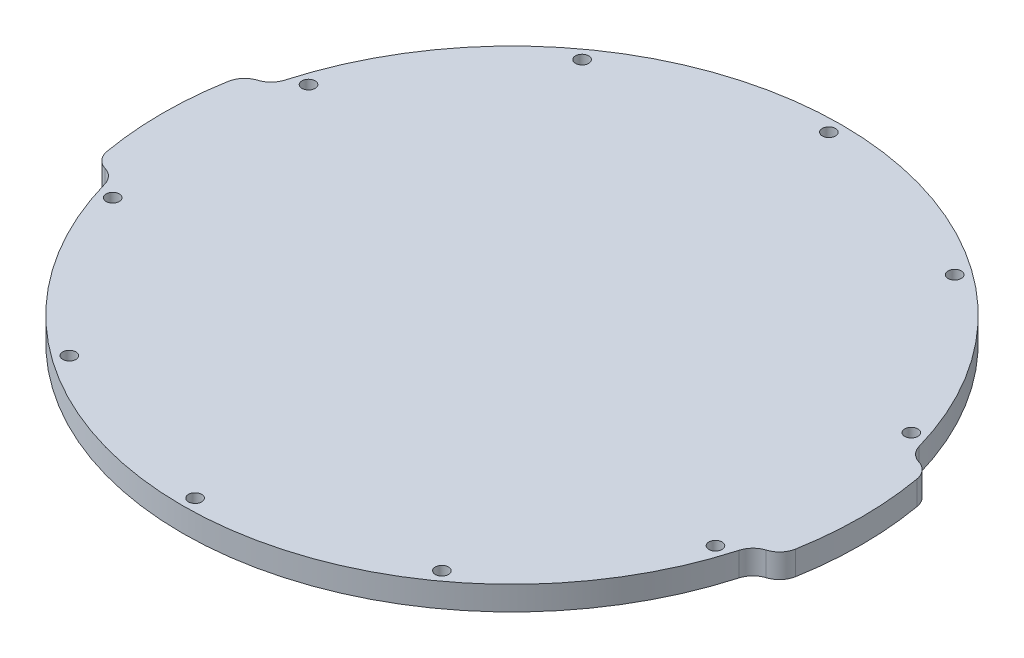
ISO-10303-21;
HEADER;
FILE_DESCRIPTION(('STEP AP214'),'2;1');
FILE_NAME('part.step','',(''),(''),'','','');
FILE_SCHEMA(('AUTOMOTIVE_DESIGN { 1 0 10303 214 1 1 1 1 }'));
ENDSEC;
DATA;
#1=APPLICATION_CONTEXT('core data for automotive mechanical design processes');
#2=APPLICATION_PROTOCOL_DEFINITION('international standard','automotive_design',2000,#1);
#3=PRODUCT_CONTEXT('',#1,'mechanical');
#4=PRODUCT('Part','Part','',(#3));
#5=PRODUCT_RELATED_PRODUCT_CATEGORY('part','',(#4));
#6=PRODUCT_DEFINITION_FORMATION('','',#4);
#7=PRODUCT_DEFINITION_CONTEXT('part definition',#1,'design');
#8=PRODUCT_DEFINITION('design','',#6,#7);
#9=PRODUCT_DEFINITION_SHAPE('','',#8);
#10=(LENGTH_UNIT() NAMED_UNIT(*) SI_UNIT(.MILLI.,.METRE.));
#11=(NAMED_UNIT(*) PLANE_ANGLE_UNIT() SI_UNIT($,.RADIAN.));
#12=(NAMED_UNIT(*) SI_UNIT($,.STERADIAN.) SOLID_ANGLE_UNIT());
#13=UNCERTAINTY_MEASURE_WITH_UNIT(LENGTH_MEASURE(1.E-05),#10,'distance_accuracy_value','');
#14=(GEOMETRIC_REPRESENTATION_CONTEXT(3) GLOBAL_UNCERTAINTY_ASSIGNED_CONTEXT((#13)) GLOBAL_UNIT_ASSIGNED_CONTEXT((#10,
#11,#12)) REPRESENTATION_CONTEXT('',''));
#15=CARTESIAN_POINT('',(0.,0.,0.));
#16=DIRECTION('',(0.,0.,1.));
#17=DIRECTION('',(1.,0.,0.));
#18=AXIS2_PLACEMENT_3D('',#15,#16,#17);
#19=CARTESIAN_POINT('',(-40.6479400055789,6.,-7.16732853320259));
#20=DIRECTION('',(0.,-1.,0.));
#21=DIRECTION('',(0.,0.,-1.));
#22=AXIS2_PLACEMENT_3D('',#19,#20,#21);
#23=PLANE('',#22);
#24=CARTESIAN_POINT('',(-75.4663345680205,6.,-24.5204985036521));
#25=DIRECTION('',(0.,1.,0.));
#26=DIRECTION('',(0.,0.,1.));
#27=AXIS2_PLACEMENT_3D('',#24,#25,#26);
#28=CIRCLE('',#27,1.6500000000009);
#29=CARTESIAN_POINT('',(-75.4663345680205,6.,-22.8704985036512));
#30=VERTEX_POINT('',#29);
#31=EDGE_CURVE('E344',#30,#30,#28,.T.);
#32=ORIENTED_EDGE('',*,*,#31,.F.);
#33=EDGE_LOOP('',(#32));
#34=FACE_BOUND('',#33,.T.);
#35=CARTESIAN_POINT('',(-46.6407597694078,6.,64.1954985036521));
#36=DIRECTION('',(0.,1.,0.));
#37=DIRECTION('',(0.,0.,1.));
#38=AXIS2_PLACEMENT_3D('',#35,#36,#37);
#39=CIRCLE('',#38,1.65000000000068);
#40=CARTESIAN_POINT('',(-46.6407597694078,6.,65.8454985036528));
#41=VERTEX_POINT('',#40);
#42=EDGE_CURVE('E332',#41,#41,#39,.T.);
#43=ORIENTED_EDGE('',*,*,#42,.F.);
#44=EDGE_LOOP('',(#43));
#45=FACE_BOUND('',#44,.T.);
#46=CARTESIAN_POINT('',(46.6407597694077,6.,64.1954985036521));
#47=DIRECTION('',(0.,1.,0.));
#48=DIRECTION('',(0.,0.,1.));
#49=AXIS2_PLACEMENT_3D('',#46,#47,#48);
#50=CIRCLE('',#49,1.65000000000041);
#51=CARTESIAN_POINT('',(46.6407597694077,6.,65.8454985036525));
#52=VERTEX_POINT('',#51);
#53=EDGE_CURVE('E320',#52,#52,#50,.T.);
#54=ORIENTED_EDGE('',*,*,#53,.F.);
#55=EDGE_LOOP('',(#54));
#56=FACE_BOUND('',#55,.T.);
#57=CARTESIAN_POINT('',(75.4663345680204,6.,-24.5204985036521));
#58=DIRECTION('',(0.,1.,0.));
#59=DIRECTION('',(0.,0.,1.));
#60=AXIS2_PLACEMENT_3D('',#57,#58,#59);
#61=CIRCLE('',#60,1.65000000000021);
#62=CARTESIAN_POINT('',(75.4663345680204,6.,-22.8704985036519));
#63=VERTEX_POINT('',#62);
#64=EDGE_CURVE('E308',#63,#63,#61,.T.);
#65=ORIENTED_EDGE('',*,*,#64,.F.);
#66=EDGE_LOOP('',(#65));
#67=FACE_BOUND('',#66,.T.);
#68=CARTESIAN_POINT('',(0.,6.,-79.35));
#69=DIRECTION('',(0.,1.,0.));
#70=DIRECTION('',(0.,0.,1.));
#71=AXIS2_PLACEMENT_3D('',#68,#69,#70);
#72=CIRCLE('',#71,1.65);
#73=CARTESIAN_POINT('',(0.,6.,-77.7));
#74=VERTEX_POINT('',#73);
#75=EDGE_CURVE('E276',#74,#74,#72,.T.);
#76=ORIENTED_EDGE('',*,*,#75,.F.);
#77=EDGE_LOOP('',(#76));
#78=FACE_BOUND('',#77,.T.);
#79=CARTESIAN_POINT('',(0.,6.,0.));
#80=DIRECTION('',(0.,1.,0.));
#81=DIRECTION('',(0.,0.,-1.));
#82=AXIS2_PLACEMENT_3D('',#79,#80,#81);
#83=CIRCLE('',#82,82.55);
#84=CARTESIAN_POINT('',(79.4156922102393,6.,-22.5310969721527));
#85=VERTEX_POINT('',#84);
#86=CARTESIAN_POINT('',(-79.4156922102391,6.,-22.531096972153));
#87=VERTEX_POINT('',#86);
#88=EDGE_CURVE('E271',#85,#87,#83,.T.);
#89=ORIENTED_EDGE('',*,*,#88,.T.);
#90=CARTESIAN_POINT('',(-84.2258492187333,6.,-23.8957909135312));
#91=DIRECTION('',(0.,-1.,0.));
#92=DIRECTION('',(0.,0.,-1.));
#93=AXIS2_PLACEMENT_3D('',#90,#91,#92);
#94=CIRCLE('',#93,5.);
#95=CARTESIAN_POINT('',(-82.7608646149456,6.,-19.1152239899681));
#96=VERTEX_POINT('',#95);
#97=EDGE_CURVE('E127',#87,#96,#94,.T.);
#98=ORIENTED_EDGE('',*,*,#97,.T.);
#99=CARTESIAN_POINT('',(-81.2958800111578,6.,-14.3346570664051));
#100=DIRECTION('',(0.,1.,0.));
#101=DIRECTION('',(0.,0.,-1.));
#102=AXIS2_PLACEMENT_3D('',#99,#100,#101);
#103=CIRCLE('',#102,5.00000000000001);
#104=CARTESIAN_POINT('',(-86.2199187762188,6.,-15.2028979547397));
#105=VERTEX_POINT('',#104);
#106=EDGE_CURVE('E120',#96,#105,#103,.T.);
#107=ORIENTED_EDGE('',*,*,#106,.T.);
#108=CARTESIAN_POINT('',(0.,6.,0.));
#109=DIRECTION('',(0.,1.,0.));
#110=DIRECTION('',(0.,0.,-1.));
#111=AXIS2_PLACEMENT_3D('',#108,#109,#110);
#112=CIRCLE('',#111,87.55);
#113=CARTESIAN_POINT('',(-86.2199187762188,6.,15.2028979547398));
#114=VERTEX_POINT('',#113);
#115=EDGE_CURVE('E124',#105,#114,#112,.T.);
#116=ORIENTED_EDGE('',*,*,#115,.T.);
#117=CARTESIAN_POINT('',(-81.2958800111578,6.,14.3346570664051));
#118=DIRECTION('',(0.,1.,0.));
#119=DIRECTION('',(0.,0.,1.));
#120=AXIS2_PLACEMENT_3D('',#117,#118,#119);
#121=CIRCLE('',#120,5.00000000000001);
#122=CARTESIAN_POINT('',(-82.7608646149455,6.,19.1152239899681));
#123=VERTEX_POINT('',#122);
#124=EDGE_CURVE('E140',#114,#123,#121,.T.);
#125=ORIENTED_EDGE('',*,*,#124,.T.);
#126=CARTESIAN_POINT('',(-84.2258492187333,6.,23.8957909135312));
#127=DIRECTION('',(0.,-1.,0.));
#128=DIRECTION('',(0.,0.,-1.));
#129=AXIS2_PLACEMENT_3D('',#126,#127,#128);
#130=CIRCLE('',#129,5.);
#131=CARTESIAN_POINT('',(-79.4156922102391,6.,22.531096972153));
#132=VERTEX_POINT('',#131);
#133=EDGE_CURVE('E11',#123,#132,#130,.T.);
#134=ORIENTED_EDGE('',*,*,#133,.T.);
#135=CARTESIAN_POINT('',(0.,6.,-4.92661467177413E-13));
#136=DIRECTION('',(0.,1.,0.));
#137=DIRECTION('',(0.,0.,-1.));
#138=AXIS2_PLACEMENT_3D('',#135,#136,#137);
#139=CIRCLE('',#138,82.5500000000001);
#140=CARTESIAN_POINT('',(79.4156922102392,6.,22.5310969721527));
#141=VERTEX_POINT('',#140);
#142=EDGE_CURVE('E258',#132,#141,#139,.T.);
#143=ORIENTED_EDGE('',*,*,#142,.T.);
#144=CARTESIAN_POINT('',(84.2258492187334,6.,23.8957909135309));
#145=DIRECTION('',(0.,-1.,0.));
#146=DIRECTION('',(0.,0.,-1.));
#147=AXIS2_PLACEMENT_3D('',#144,#145,#146);
#148=CIRCLE('',#147,5.);
#149=CARTESIAN_POINT('',(82.7608646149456,6.,19.1152239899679));
#150=VERTEX_POINT('',#149);
#151=EDGE_CURVE('E171',#141,#150,#148,.T.);
#152=ORIENTED_EDGE('',*,*,#151,.T.);
#153=CARTESIAN_POINT('',(81.2958800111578,6.,14.3346570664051));
#154=DIRECTION('',(0.,1.,0.));
#155=DIRECTION('',(0.,0.,-1.));
#156=AXIS2_PLACEMENT_3D('',#153,#154,#155);
#157=CIRCLE('',#156,4.99999999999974);
#158=CARTESIAN_POINT('',(86.2199187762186,6.,15.2028979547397));
#159=VERTEX_POINT('',#158);
#160=EDGE_CURVE('E255',#150,#159,#157,.T.);
#161=ORIENTED_EDGE('',*,*,#160,.T.);
#162=CARTESIAN_POINT('',(-1.29063426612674E-12,6.,0.));
#163=DIRECTION('',(0.,1.,0.));
#164=DIRECTION('',(0.,0.,1.));
#165=AXIS2_PLACEMENT_3D('',#162,#163,#164);
#166=CIRCLE('',#165,87.550000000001);
#167=CARTESIAN_POINT('',(86.2199187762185,6.,-15.2028979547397));
#168=VERTEX_POINT('',#167);
#169=EDGE_CURVE('E262',#159,#168,#166,.T.);
#170=ORIENTED_EDGE('',*,*,#169,.T.);
#171=CARTESIAN_POINT('',(81.2958800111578,6.,-14.3346570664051));
#172=DIRECTION('',(0.,1.,0.));
#173=DIRECTION('',(0.,0.,1.));
#174=AXIS2_PLACEMENT_3D('',#171,#172,#173);
#175=CIRCLE('',#174,4.99999999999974);
#176=CARTESIAN_POINT('',(82.7608646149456,6.,-19.1152239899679));
#177=VERTEX_POINT('',#176);
#178=EDGE_CURVE('E264',#168,#177,#175,.T.);
#179=ORIENTED_EDGE('',*,*,#178,.T.);
#180=CARTESIAN_POINT('',(84.2258492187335,6.,-23.8957909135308));
#181=DIRECTION('',(0.,-1.,0.));
#182=DIRECTION('',(0.,0.,-1.));
#183=AXIS2_PLACEMENT_3D('',#180,#181,#182);
#184=CIRCLE('',#183,5.);
#185=EDGE_CURVE('E175',#177,#85,#184,.T.);
#186=ORIENTED_EDGE('',*,*,#185,.T.);
#187=EDGE_LOOP('',(#89,#98,#107,#116,#125,#134,#143,#152,#161,#170,#179,#186));
#188=FACE_BOUND('',#187,.T.);
#189=CARTESIAN_POINT('',(46.6407597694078,6.,-64.1954985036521));
#190=DIRECTION('',(0.,1.,0.));
#191=DIRECTION('',(0.,0.,1.));
#192=AXIS2_PLACEMENT_3D('',#189,#190,#191);
#193=CIRCLE('',#192,1.65000000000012);
#194=CARTESIAN_POINT('',(46.6407597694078,6.,-62.5454985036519));
#195=VERTEX_POINT('',#194);
#196=EDGE_CURVE('E302',#195,#195,#193,.T.);
#197=ORIENTED_EDGE('',*,*,#196,.F.);
#198=EDGE_LOOP('',(#197));
#199=FACE_BOUND('',#198,.T.);
#200=CARTESIAN_POINT('',(75.4663345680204,6.,24.5204985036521));
#201=DIRECTION('',(0.,1.,0.));
#202=DIRECTION('',(0.,0.,1.));
#203=AXIS2_PLACEMENT_3D('',#200,#201,#202);
#204=CIRCLE('',#203,1.65000000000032);
#205=CARTESIAN_POINT('',(75.4663345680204,6.,26.1704985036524));
#206=VERTEX_POINT('',#205);
#207=EDGE_CURVE('E314',#206,#206,#204,.T.);
#208=ORIENTED_EDGE('',*,*,#207,.F.);
#209=EDGE_LOOP('',(#208));
#210=FACE_BOUND('',#209,.T.);
#211=CARTESIAN_POINT('',(0.,6.,79.35));
#212=DIRECTION('',(0.,1.,0.));
#213=DIRECTION('',(0.,0.,1.));
#214=AXIS2_PLACEMENT_3D('',#211,#212,#213);
#215=CIRCLE('',#214,1.65000000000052);
#216=CARTESIAN_POINT('',(0.,6.,81.0000000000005));
#217=VERTEX_POINT('',#216);
#218=EDGE_CURVE('E326',#217,#217,#215,.T.);
#219=ORIENTED_EDGE('',*,*,#218,.F.);
#220=EDGE_LOOP('',(#219));
#221=FACE_BOUND('',#220,.T.);
#222=CARTESIAN_POINT('',(-75.4663345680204,6.,24.5204985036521));
#223=DIRECTION('',(0.,1.,0.));
#224=DIRECTION('',(0.,0.,1.));
#225=AXIS2_PLACEMENT_3D('',#222,#223,#224);
#226=CIRCLE('',#225,1.65000000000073);
#227=CARTESIAN_POINT('',(-75.4663345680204,6.,26.1704985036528));
#228=VERTEX_POINT('',#227);
#229=EDGE_CURVE('E338',#228,#228,#226,.T.);
#230=ORIENTED_EDGE('',*,*,#229,.F.);
#231=EDGE_LOOP('',(#230));
#232=FACE_BOUND('',#231,.T.);
#233=CARTESIAN_POINT('',(-46.6407597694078,6.,-64.1954985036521));
#234=DIRECTION('',(0.,1.,0.));
#235=DIRECTION('',(0.,0.,1.));
#236=AXIS2_PLACEMENT_3D('',#233,#234,#235);
#237=CIRCLE('',#236,1.65000000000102);
#238=CARTESIAN_POINT('',(-46.6407597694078,6.,-62.545498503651));
#239=VERTEX_POINT('',#238);
#240=EDGE_CURVE('E350',#239,#239,#237,.T.);
#241=ORIENTED_EDGE('',*,*,#240,.F.);
#242=EDGE_LOOP('',(#241));
#243=FACE_BOUND('',#242,.T.);
#244=ADVANCED_FACE('F32',(#34,#45,#56,#67,#78,#188,#199,#210,#221,#232,#243),#23,.F.);
#245=CARTESIAN_POINT('',(-40.6479400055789,0.,-7.16732853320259));
#246=DIRECTION('',(0.,-1.,0.));
#247=DIRECTION('',(0.,0.,-1.));
#248=AXIS2_PLACEMENT_3D('',#245,#246,#247);
#249=PLANE('',#248);
#250=CARTESIAN_POINT('',(-75.4663345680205,0.,-24.5204985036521));
#251=DIRECTION('',(0.,1.,0.));
#252=DIRECTION('',(0.,0.,1.));
#253=AXIS2_PLACEMENT_3D('',#250,#251,#252);
#254=CIRCLE('',#253,1.6500000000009);
#255=CARTESIAN_POINT('',(-75.4663345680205,0.,-22.8704985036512));
#256=VERTEX_POINT('',#255);
#257=EDGE_CURVE('E347',#256,#256,#254,.T.);
#258=ORIENTED_EDGE('',*,*,#257,.T.);
#259=EDGE_LOOP('',(#258));
#260=FACE_BOUND('',#259,.T.);
#261=CARTESIAN_POINT('',(-46.6407597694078,0.,64.1954985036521));
#262=DIRECTION('',(0.,1.,0.));
#263=DIRECTION('',(0.,0.,1.));
#264=AXIS2_PLACEMENT_3D('',#261,#262,#263);
#265=CIRCLE('',#264,1.65000000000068);
#266=CARTESIAN_POINT('',(-46.6407597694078,0.,65.8454985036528));
#267=VERTEX_POINT('',#266);
#268=EDGE_CURVE('E335',#267,#267,#265,.T.);
#269=ORIENTED_EDGE('',*,*,#268,.T.);
#270=EDGE_LOOP('',(#269));
#271=FACE_BOUND('',#270,.T.);
#272=CARTESIAN_POINT('',(46.6407597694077,0.,64.1954985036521));
#273=DIRECTION('',(0.,1.,0.));
#274=DIRECTION('',(0.,0.,1.));
#275=AXIS2_PLACEMENT_3D('',#272,#273,#274);
#276=CIRCLE('',#275,1.65000000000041);
#277=CARTESIAN_POINT('',(46.6407597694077,0.,65.8454985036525));
#278=VERTEX_POINT('',#277);
#279=EDGE_CURVE('E323',#278,#278,#276,.T.);
#280=ORIENTED_EDGE('',*,*,#279,.T.);
#281=EDGE_LOOP('',(#280));
#282=FACE_BOUND('',#281,.T.);
#283=CARTESIAN_POINT('',(75.4663345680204,0.,-24.5204985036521));
#284=DIRECTION('',(0.,1.,0.));
#285=DIRECTION('',(0.,0.,1.));
#286=AXIS2_PLACEMENT_3D('',#283,#284,#285);
#287=CIRCLE('',#286,1.65000000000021);
#288=CARTESIAN_POINT('',(75.4663345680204,0.,-22.8704985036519));
#289=VERTEX_POINT('',#288);
#290=EDGE_CURVE('E311',#289,#289,#287,.T.);
#291=ORIENTED_EDGE('',*,*,#290,.T.);
#292=EDGE_LOOP('',(#291));
#293=FACE_BOUND('',#292,.T.);
#294=CARTESIAN_POINT('',(0.,0.,-79.35));
#295=DIRECTION('',(0.,1.,0.));
#296=DIRECTION('',(0.,0.,1.));
#297=AXIS2_PLACEMENT_3D('',#294,#295,#296);
#298=CIRCLE('',#297,1.65);
#299=CARTESIAN_POINT('',(0.,0.,-77.7));
#300=VERTEX_POINT('',#299);
#301=EDGE_CURVE('E299',#300,#300,#298,.T.);
#302=ORIENTED_EDGE('',*,*,#301,.T.);
#303=EDGE_LOOP('',(#302));
#304=FACE_BOUND('',#303,.T.);
#305=CARTESIAN_POINT('',(-81.2958800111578,0.,-14.3346570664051));
#306=DIRECTION('',(0.,1.,0.));
#307=DIRECTION('',(0.,0.,-1.));
#308=AXIS2_PLACEMENT_3D('',#305,#306,#307);
#309=CIRCLE('',#308,5.00000000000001);
#310=CARTESIAN_POINT('',(-82.7608646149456,0.,-19.1152239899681));
#311=VERTEX_POINT('',#310);
#312=CARTESIAN_POINT('',(-86.2199187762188,0.,-15.2028979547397));
#313=VERTEX_POINT('',#312);
#314=EDGE_CURVE('E144',#311,#313,#309,.T.);
#315=ORIENTED_EDGE('',*,*,#314,.F.);
#316=CARTESIAN_POINT('',(-84.2258492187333,0.,-23.8957909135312));
#317=DIRECTION('',(0.,-1.,0.));
#318=DIRECTION('',(0.,0.,-1.));
#319=AXIS2_PLACEMENT_3D('',#316,#317,#318);
#320=CIRCLE('',#319,5.);
#321=CARTESIAN_POINT('',(-79.4156922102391,0.,-22.531096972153));
#322=VERTEX_POINT('',#321);
#323=EDGE_CURVE('E177',#311,#322,#320,.F.);
#324=ORIENTED_EDGE('',*,*,#323,.T.);
#325=CARTESIAN_POINT('',(0.,0.,0.));
#326=DIRECTION('',(0.,1.,0.));
#327=DIRECTION('',(0.,0.,-1.));
#328=AXIS2_PLACEMENT_3D('',#325,#326,#327);
#329=CIRCLE('',#328,82.55);
#330=CARTESIAN_POINT('',(79.4156922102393,0.,-22.5310969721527));
#331=VERTEX_POINT('',#330);
#332=EDGE_CURVE('E132',#331,#322,#329,.T.);
#333=ORIENTED_EDGE('',*,*,#332,.F.);
#334=CARTESIAN_POINT('',(84.2258492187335,0.,-23.8957909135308));
#335=DIRECTION('',(0.,-1.,0.));
#336=DIRECTION('',(0.,0.,-1.));
#337=AXIS2_PLACEMENT_3D('',#334,#335,#336);
#338=CIRCLE('',#337,5.);
#339=CARTESIAN_POINT('',(82.7608646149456,0.,-19.1152239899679));
#340=VERTEX_POINT('',#339);
#341=EDGE_CURVE('E173',#331,#340,#338,.F.);
#342=ORIENTED_EDGE('',*,*,#341,.T.);
#343=CARTESIAN_POINT('',(81.2958800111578,0.,-14.3346570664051));
#344=DIRECTION('',(0.,1.,0.));
#345=DIRECTION('',(0.,0.,1.));
#346=AXIS2_PLACEMENT_3D('',#343,#344,#345);
#347=CIRCLE('',#346,4.99999999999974);
#348=CARTESIAN_POINT('',(86.2199187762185,0.,-15.2028979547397));
#349=VERTEX_POINT('',#348);
#350=EDGE_CURVE('E189',#349,#340,#347,.T.);
#351=ORIENTED_EDGE('',*,*,#350,.F.);
#352=CARTESIAN_POINT('',(-1.29063426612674E-12,0.,0.));
#353=DIRECTION('',(0.,1.,0.));
#354=DIRECTION('',(0.,0.,1.));
#355=AXIS2_PLACEMENT_3D('',#352,#353,#354);
#356=CIRCLE('',#355,87.550000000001);
#357=CARTESIAN_POINT('',(86.2199187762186,0.,15.2028979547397));
#358=VERTEX_POINT('',#357);
#359=EDGE_CURVE('E285',#358,#349,#356,.T.);
#360=ORIENTED_EDGE('',*,*,#359,.F.);
#361=CARTESIAN_POINT('',(81.2958800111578,0.,14.3346570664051));
#362=DIRECTION('',(0.,1.,0.));
#363=DIRECTION('',(0.,0.,-1.));
#364=AXIS2_PLACEMENT_3D('',#361,#362,#363);
#365=CIRCLE('',#364,4.99999999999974);
#366=CARTESIAN_POINT('',(82.7608646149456,0.,19.1152239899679));
#367=VERTEX_POINT('',#366);
#368=EDGE_CURVE('E283',#367,#358,#365,.T.);
#369=ORIENTED_EDGE('',*,*,#368,.F.);
#370=CARTESIAN_POINT('',(84.2258492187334,0.,23.8957909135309));
#371=DIRECTION('',(0.,-1.,0.));
#372=DIRECTION('',(0.,0.,-1.));
#373=AXIS2_PLACEMENT_3D('',#370,#371,#372);
#374=CIRCLE('',#373,5.);
#375=CARTESIAN_POINT('',(79.4156922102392,0.,22.5310969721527));
#376=VERTEX_POINT('',#375);
#377=EDGE_CURVE('E169',#367,#376,#374,.F.);
#378=ORIENTED_EDGE('',*,*,#377,.T.);
#379=CARTESIAN_POINT('',(0.,0.,-4.92661467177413E-13));
#380=DIRECTION('',(0.,1.,0.));
#381=DIRECTION('',(0.,0.,-1.));
#382=AXIS2_PLACEMENT_3D('',#379,#380,#381);
#383=CIRCLE('',#382,82.5500000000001);
#384=CARTESIAN_POINT('',(-79.4156922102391,0.,22.531096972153));
#385=VERTEX_POINT('',#384);
#386=EDGE_CURVE('E280',#385,#376,#383,.T.);
#387=ORIENTED_EDGE('',*,*,#386,.F.);
#388=CARTESIAN_POINT('',(-84.2258492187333,0.,23.8957909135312));
#389=DIRECTION('',(0.,-1.,0.));
#390=DIRECTION('',(0.,0.,-1.));
#391=AXIS2_PLACEMENT_3D('',#388,#389,#390);
#392=CIRCLE('',#391,5.);
#393=CARTESIAN_POINT('',(-82.7608646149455,0.,19.1152239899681));
#394=VERTEX_POINT('',#393);
#395=EDGE_CURVE('E40',#385,#394,#392,.F.);
#396=ORIENTED_EDGE('',*,*,#395,.T.);
#397=CARTESIAN_POINT('',(-81.2958800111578,0.,14.3346570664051));
#398=DIRECTION('',(0.,1.,0.));
#399=DIRECTION('',(0.,0.,1.));
#400=AXIS2_PLACEMENT_3D('',#397,#398,#399);
#401=CIRCLE('',#400,5.00000000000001);
#402=CARTESIAN_POINT('',(-86.2199187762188,0.,15.2028979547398));
#403=VERTEX_POINT('',#402);
#404=EDGE_CURVE('E278',#403,#394,#401,.T.);
#405=ORIENTED_EDGE('',*,*,#404,.F.);
#406=CARTESIAN_POINT('',(0.,0.,0.));
#407=DIRECTION('',(0.,1.,0.));
#408=DIRECTION('',(0.,0.,-1.));
#409=AXIS2_PLACEMENT_3D('',#406,#407,#408);
#410=CIRCLE('',#409,87.55);
#411=EDGE_CURVE('E275',#313,#403,#410,.T.);
#412=ORIENTED_EDGE('',*,*,#411,.F.);
#413=EDGE_LOOP('',(#315,#324,#333,#342,#351,#360,#369,#378,#387,#396,#405,#412));
#414=FACE_BOUND('',#413,.T.);
#415=CARTESIAN_POINT('',(46.6407597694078,0.,-64.1954985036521));
#416=DIRECTION('',(0.,1.,0.));
#417=DIRECTION('',(0.,0.,1.));
#418=AXIS2_PLACEMENT_3D('',#415,#416,#417);
#419=CIRCLE('',#418,1.65000000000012);
#420=CARTESIAN_POINT('',(46.6407597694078,0.,-62.5454985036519));
#421=VERTEX_POINT('',#420);
#422=EDGE_CURVE('E305',#421,#421,#419,.T.);
#423=ORIENTED_EDGE('',*,*,#422,.T.);
#424=EDGE_LOOP('',(#423));
#425=FACE_BOUND('',#424,.T.);
#426=CARTESIAN_POINT('',(75.4663345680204,0.,24.5204985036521));
#427=DIRECTION('',(0.,1.,0.));
#428=DIRECTION('',(0.,0.,1.));
#429=AXIS2_PLACEMENT_3D('',#426,#427,#428);
#430=CIRCLE('',#429,1.65000000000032);
#431=CARTESIAN_POINT('',(75.4663345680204,0.,26.1704985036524));
#432=VERTEX_POINT('',#431);
#433=EDGE_CURVE('E317',#432,#432,#430,.T.);
#434=ORIENTED_EDGE('',*,*,#433,.T.);
#435=EDGE_LOOP('',(#434));
#436=FACE_BOUND('',#435,.T.);
#437=CARTESIAN_POINT('',(0.,0.,79.35));
#438=DIRECTION('',(0.,1.,0.));
#439=DIRECTION('',(0.,0.,1.));
#440=AXIS2_PLACEMENT_3D('',#437,#438,#439);
#441=CIRCLE('',#440,1.65000000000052);
#442=CARTESIAN_POINT('',(0.,0.,81.0000000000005));
#443=VERTEX_POINT('',#442);
#444=EDGE_CURVE('E329',#443,#443,#441,.T.);
#445=ORIENTED_EDGE('',*,*,#444,.T.);
#446=EDGE_LOOP('',(#445));
#447=FACE_BOUND('',#446,.T.);
#448=CARTESIAN_POINT('',(-75.4663345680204,0.,24.5204985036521));
#449=DIRECTION('',(0.,1.,0.));
#450=DIRECTION('',(0.,0.,1.));
#451=AXIS2_PLACEMENT_3D('',#448,#449,#450);
#452=CIRCLE('',#451,1.65000000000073);
#453=CARTESIAN_POINT('',(-75.4663345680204,0.,26.1704985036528));
#454=VERTEX_POINT('',#453);
#455=EDGE_CURVE('E341',#454,#454,#452,.T.);
#456=ORIENTED_EDGE('',*,*,#455,.T.);
#457=EDGE_LOOP('',(#456));
#458=FACE_BOUND('',#457,.T.);
#459=CARTESIAN_POINT('',(-46.6407597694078,0.,-64.1954985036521));
#460=DIRECTION('',(0.,1.,0.));
#461=DIRECTION('',(0.,0.,1.));
#462=AXIS2_PLACEMENT_3D('',#459,#460,#461);
#463=CIRCLE('',#462,1.65000000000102);
#464=CARTESIAN_POINT('',(-46.6407597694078,0.,-62.545498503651));
#465=VERTEX_POINT('',#464);
#466=EDGE_CURVE('E353',#465,#465,#463,.T.);
#467=ORIENTED_EDGE('',*,*,#466,.T.);
#468=EDGE_LOOP('',(#467));
#469=FACE_BOUND('',#468,.T.);
#470=ADVANCED_FACE('F181',(#260,#271,#282,#293,#304,#414,#425,#436,#447,#458,#469),#249,.T.);
#471=CARTESIAN_POINT('',(-81.2958800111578,6.,-14.3346570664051));
#472=DIRECTION('',(0.,-1.,0.));
#473=DIRECTION('',(0.,0.,-1.));
#474=AXIS2_PLACEMENT_3D('',#471,#472,#473);
#475=CYLINDRICAL_SURFACE('',#474,5.00000000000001);
#476=ORIENTED_EDGE('',*,*,#106,.F.);
#477=DIRECTION('',(0.,-1.,0.));
#478=VECTOR('',#477,1.);
#479=CARTESIAN_POINT('',(-82.7608646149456,6.,-19.1152239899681));
#480=LINE('',#479,#478);
#481=EDGE_CURVE('E166',#96,#311,#480,.T.);
#482=ORIENTED_EDGE('',*,*,#481,.T.);
#483=ORIENTED_EDGE('',*,*,#314,.T.);
#484=DIRECTION('',(0.,-1.,0.));
#485=VECTOR('',#484,1.);
#486=CARTESIAN_POINT('',(-86.2199187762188,6.,-15.2028979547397));
#487=LINE('',#486,#485);
#488=EDGE_CURVE('E137',#105,#313,#487,.T.);
#489=ORIENTED_EDGE('',*,*,#488,.F.);
#490=EDGE_LOOP('',(#476,#482,#483,#489));
#491=FACE_BOUND('',#490,.T.);
#492=ADVANCED_FACE('F142',(#491),#475,.T.);
#493=CARTESIAN_POINT('',(0.,6.,0.));
#494=DIRECTION('',(0.,-1.,0.));
#495=DIRECTION('',(0.,0.,-1.));
#496=AXIS2_PLACEMENT_3D('',#493,#494,#495);
#497=CYLINDRICAL_SURFACE('',#496,87.55);
#498=ORIENTED_EDGE('',*,*,#411,.T.);
#499=DIRECTION('',(0.,-1.,0.));
#500=VECTOR('',#499,1.);
#501=CARTESIAN_POINT('',(-86.2199187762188,6.,15.2028979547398));
#502=LINE('',#501,#500);
#503=EDGE_CURVE('E139',#114,#403,#502,.T.);
#504=ORIENTED_EDGE('',*,*,#503,.F.);
#505=ORIENTED_EDGE('',*,*,#115,.F.);
#506=ORIENTED_EDGE('',*,*,#488,.T.);
#507=EDGE_LOOP('',(#498,#504,#505,#506));
#508=FACE_BOUND('',#507,.T.);
#509=ADVANCED_FACE('F136',(#508),#497,.T.);
#510=CARTESIAN_POINT('',(-81.2958800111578,6.,14.3346570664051));
#511=DIRECTION('',(0.,-1.,0.));
#512=DIRECTION('',(0.,0.,-1.));
#513=AXIS2_PLACEMENT_3D('',#510,#511,#512);
#514=CYLINDRICAL_SURFACE('',#513,5.00000000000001);
#515=ORIENTED_EDGE('',*,*,#404,.T.);
#516=DIRECTION('',(0.,-1.,0.));
#517=VECTOR('',#516,1.);
#518=CARTESIAN_POINT('',(-82.7608646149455,6.,19.1152239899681));
#519=LINE('',#518,#517);
#520=EDGE_CURVE('E47',#394,#123,#519,.F.);
#521=ORIENTED_EDGE('',*,*,#520,.T.);
#522=ORIENTED_EDGE('',*,*,#124,.F.);
#523=ORIENTED_EDGE('',*,*,#503,.T.);
#524=EDGE_LOOP('',(#515,#521,#522,#523));
#525=FACE_BOUND('',#524,.T.);
#526=ADVANCED_FACE('F233',(#525),#514,.T.);
#527=CARTESIAN_POINT('',(0.,6.,-4.92661467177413E-13));
#528=DIRECTION('',(0.,-1.,0.));
#529=DIRECTION('',(0.,0.,-1.));
#530=AXIS2_PLACEMENT_3D('',#527,#528,#529);
#531=CYLINDRICAL_SURFACE('',#530,82.5500000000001);
#532=ORIENTED_EDGE('',*,*,#386,.T.);
#533=DIRECTION('',(0.,-1.,0.));
#534=VECTOR('',#533,1.);
#535=CARTESIAN_POINT('',(79.4156922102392,6.,22.5310969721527));
#536=LINE('',#535,#534);
#537=EDGE_CURVE('E157',#376,#141,#536,.F.);
#538=ORIENTED_EDGE('',*,*,#537,.T.);
#539=ORIENTED_EDGE('',*,*,#142,.F.);
#540=DIRECTION('',(0.,-1.,0.));
#541=VECTOR('',#540,1.);
#542=CARTESIAN_POINT('',(-79.4156922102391,6.,22.531096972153));
#543=LINE('',#542,#541);
#544=EDGE_CURVE('E149',#132,#385,#543,.T.);
#545=ORIENTED_EDGE('',*,*,#544,.T.);
#546=EDGE_LOOP('',(#532,#538,#539,#545));
#547=FACE_BOUND('',#546,.T.);
#548=ADVANCED_FACE('F229',(#547),#531,.T.);
#549=CARTESIAN_POINT('',(81.2958800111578,6.,14.3346570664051));
#550=DIRECTION('',(0.,-1.,0.));
#551=DIRECTION('',(0.,0.,-1.));
#552=AXIS2_PLACEMENT_3D('',#549,#550,#551);
#553=CYLINDRICAL_SURFACE('',#552,4.99999999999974);
#554=ORIENTED_EDGE('',*,*,#160,.F.);
#555=DIRECTION('',(0.,-1.,0.));
#556=VECTOR('',#555,1.);
#557=CARTESIAN_POINT('',(82.7608646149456,6.,19.1152239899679));
#558=LINE('',#557,#556);
#559=EDGE_CURVE('E146',#150,#367,#558,.T.);
#560=ORIENTED_EDGE('',*,*,#559,.T.);
#561=ORIENTED_EDGE('',*,*,#368,.T.);
#562=DIRECTION('',(0.,-1.,0.));
#563=VECTOR('',#562,1.);
#564=CARTESIAN_POINT('',(86.2199187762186,6.,15.2028979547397));
#565=LINE('',#564,#563);
#566=EDGE_CURVE('E151',#159,#358,#565,.T.);
#567=ORIENTED_EDGE('',*,*,#566,.F.);
#568=EDGE_LOOP('',(#554,#560,#561,#567));
#569=FACE_BOUND('',#568,.T.);
#570=ADVANCED_FACE('F225',(#569),#553,.T.);
#571=CARTESIAN_POINT('',(-1.29063426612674E-12,6.,0.));
#572=DIRECTION('',(0.,-1.,0.));
#573=DIRECTION('',(0.,0.,-1.));
#574=AXIS2_PLACEMENT_3D('',#571,#572,#573);
#575=CYLINDRICAL_SURFACE('',#574,87.550000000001);
#576=ORIENTED_EDGE('',*,*,#359,.T.);
#577=DIRECTION('',(0.,-1.,0.));
#578=VECTOR('',#577,1.);
#579=CARTESIAN_POINT('',(86.2199187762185,6.,-15.2028979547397));
#580=LINE('',#579,#578);
#581=EDGE_CURVE('E273',#168,#349,#580,.T.);
#582=ORIENTED_EDGE('',*,*,#581,.F.);
#583=ORIENTED_EDGE('',*,*,#169,.F.);
#584=ORIENTED_EDGE('',*,*,#566,.T.);
#585=EDGE_LOOP('',(#576,#582,#583,#584));
#586=FACE_BOUND('',#585,.T.);
#587=ADVANCED_FACE('F221',(#586),#575,.T.);
#588=CARTESIAN_POINT('',(81.2958800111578,6.,-14.3346570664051));
#589=DIRECTION('',(0.,-1.,0.));
#590=DIRECTION('',(0.,0.,-1.));
#591=AXIS2_PLACEMENT_3D('',#588,#589,#590);
#592=CYLINDRICAL_SURFACE('',#591,4.99999999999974);
#593=ORIENTED_EDGE('',*,*,#350,.T.);
#594=DIRECTION('',(0.,-1.,0.));
#595=VECTOR('',#594,1.);
#596=CARTESIAN_POINT('',(82.7608646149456,6.,-19.1152239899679));
#597=LINE('',#596,#595);
#598=EDGE_CURVE('E164',#340,#177,#597,.F.);
#599=ORIENTED_EDGE('',*,*,#598,.T.);
#600=ORIENTED_EDGE('',*,*,#178,.F.);
#601=ORIENTED_EDGE('',*,*,#581,.T.);
#602=EDGE_LOOP('',(#593,#599,#600,#601));
#603=FACE_BOUND('',#602,.T.);
#604=ADVANCED_FACE('F218',(#603),#592,.T.);
#605=CARTESIAN_POINT('',(0.,6.,0.));
#606=DIRECTION('',(0.,-1.,0.));
#607=DIRECTION('',(0.,0.,-1.));
#608=AXIS2_PLACEMENT_3D('',#605,#606,#607);
#609=CYLINDRICAL_SURFACE('',#608,82.55);
#610=ORIENTED_EDGE('',*,*,#88,.F.);
#611=DIRECTION('',(0.,-1.,0.));
#612=VECTOR('',#611,1.);
#613=CARTESIAN_POINT('',(79.4156922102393,6.,-22.5310969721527));
#614=LINE('',#613,#612);
#615=EDGE_CURVE('E161',#85,#331,#614,.T.);
#616=ORIENTED_EDGE('',*,*,#615,.T.);
#617=ORIENTED_EDGE('',*,*,#332,.T.);
#618=DIRECTION('',(0.,-1.,0.));
#619=VECTOR('',#618,1.);
#620=CARTESIAN_POINT('',(-79.4156922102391,6.,-22.531096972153));
#621=LINE('',#620,#619);
#622=EDGE_CURVE('E159',#322,#87,#621,.F.);
#623=ORIENTED_EDGE('',*,*,#622,.T.);
#624=EDGE_LOOP('',(#610,#616,#617,#623));
#625=FACE_BOUND('',#624,.T.);
#626=ADVANCED_FACE('F187',(#625),#609,.T.);
#627=CARTESIAN_POINT('',(0.,6.,-79.35));
#628=DIRECTION('',(0.,-1.,0.));
#629=DIRECTION('',(0.,0.,-1.));
#630=AXIS2_PLACEMENT_3D('',#627,#628,#629);
#631=CYLINDRICAL_SURFACE('',#630,1.65);
#632=ORIENTED_EDGE('',*,*,#75,.T.);
#633=EDGE_LOOP('',(#632));
#634=FACE_BOUND('',#633,.T.);
#635=ORIENTED_EDGE('',*,*,#301,.F.);
#636=EDGE_LOOP('',(#635));
#637=FACE_BOUND('',#636,.T.);
#638=ADVANCED_FACE('F213',(#634,#637),#631,.F.);
#639=CARTESIAN_POINT('',(46.6407597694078,6.,-64.1954985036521));
#640=DIRECTION('',(0.,-1.,0.));
#641=DIRECTION('',(0.,0.,-1.));
#642=AXIS2_PLACEMENT_3D('',#639,#640,#641);
#643=CYLINDRICAL_SURFACE('',#642,1.65000000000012);
#644=ORIENTED_EDGE('',*,*,#196,.T.);
#645=EDGE_LOOP('',(#644));
#646=FACE_BOUND('',#645,.T.);
#647=ORIENTED_EDGE('',*,*,#422,.F.);
#648=EDGE_LOOP('',(#647));
#649=FACE_BOUND('',#648,.T.);
#650=ADVANCED_FACE('F378',(#646,#649),#643,.F.);
#651=CARTESIAN_POINT('',(75.4663345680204,6.,-24.5204985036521));
#652=DIRECTION('',(0.,-1.,0.));
#653=DIRECTION('',(0.,0.,-1.));
#654=AXIS2_PLACEMENT_3D('',#651,#652,#653);
#655=CYLINDRICAL_SURFACE('',#654,1.65000000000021);
#656=ORIENTED_EDGE('',*,*,#64,.T.);
#657=EDGE_LOOP('',(#656));
#658=FACE_BOUND('',#657,.T.);
#659=ORIENTED_EDGE('',*,*,#290,.F.);
#660=EDGE_LOOP('',(#659));
#661=FACE_BOUND('',#660,.T.);
#662=ADVANCED_FACE('F383',(#658,#661),#655,.F.);
#663=CARTESIAN_POINT('',(75.4663345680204,6.,24.5204985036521));
#664=DIRECTION('',(0.,-1.,0.));
#665=DIRECTION('',(0.,0.,-1.));
#666=AXIS2_PLACEMENT_3D('',#663,#664,#665);
#667=CYLINDRICAL_SURFACE('',#666,1.65000000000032);
#668=ORIENTED_EDGE('',*,*,#207,.T.);
#669=EDGE_LOOP('',(#668));
#670=FACE_BOUND('',#669,.T.);
#671=ORIENTED_EDGE('',*,*,#433,.F.);
#672=EDGE_LOOP('',(#671));
#673=FACE_BOUND('',#672,.T.);
#674=ADVANCED_FACE('F390',(#670,#673),#667,.F.);
#675=CARTESIAN_POINT('',(46.6407597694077,6.,64.1954985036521));
#676=DIRECTION('',(0.,-1.,0.));
#677=DIRECTION('',(0.,0.,-1.));
#678=AXIS2_PLACEMENT_3D('',#675,#676,#677);
#679=CYLINDRICAL_SURFACE('',#678,1.65000000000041);
#680=ORIENTED_EDGE('',*,*,#53,.T.);
#681=EDGE_LOOP('',(#680));
#682=FACE_BOUND('',#681,.T.);
#683=ORIENTED_EDGE('',*,*,#279,.F.);
#684=EDGE_LOOP('',(#683));
#685=FACE_BOUND('',#684,.T.);
#686=ADVANCED_FACE('F397',(#682,#685),#679,.F.);
#687=CARTESIAN_POINT('',(0.,6.,79.35));
#688=DIRECTION('',(0.,-1.,0.));
#689=DIRECTION('',(0.,0.,-1.));
#690=AXIS2_PLACEMENT_3D('',#687,#688,#689);
#691=CYLINDRICAL_SURFACE('',#690,1.65000000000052);
#692=ORIENTED_EDGE('',*,*,#218,.T.);
#693=EDGE_LOOP('',(#692));
#694=FACE_BOUND('',#693,.T.);
#695=ORIENTED_EDGE('',*,*,#444,.F.);
#696=EDGE_LOOP('',(#695));
#697=FACE_BOUND('',#696,.T.);
#698=ADVANCED_FACE('F401',(#694,#697),#691,.F.);
#699=CARTESIAN_POINT('',(-46.6407597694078,6.,64.1954985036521));
#700=DIRECTION('',(0.,-1.,0.));
#701=DIRECTION('',(0.,0.,-1.));
#702=AXIS2_PLACEMENT_3D('',#699,#700,#701);
#703=CYLINDRICAL_SURFACE('',#702,1.65000000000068);
#704=ORIENTED_EDGE('',*,*,#42,.T.);
#705=EDGE_LOOP('',(#704));
#706=FACE_BOUND('',#705,.T.);
#707=ORIENTED_EDGE('',*,*,#268,.F.);
#708=EDGE_LOOP('',(#707));
#709=FACE_BOUND('',#708,.T.);
#710=ADVANCED_FACE('F405',(#706,#709),#703,.F.);
#711=CARTESIAN_POINT('',(-75.4663345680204,6.,24.5204985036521));
#712=DIRECTION('',(0.,-1.,0.));
#713=DIRECTION('',(0.,0.,-1.));
#714=AXIS2_PLACEMENT_3D('',#711,#712,#713);
#715=CYLINDRICAL_SURFACE('',#714,1.65000000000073);
#716=ORIENTED_EDGE('',*,*,#229,.T.);
#717=EDGE_LOOP('',(#716));
#718=FACE_BOUND('',#717,.T.);
#719=ORIENTED_EDGE('',*,*,#455,.F.);
#720=EDGE_LOOP('',(#719));
#721=FACE_BOUND('',#720,.T.);
#722=ADVANCED_FACE('F365',(#718,#721),#715,.F.);
#723=CARTESIAN_POINT('',(-75.4663345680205,6.,-24.5204985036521));
#724=DIRECTION('',(0.,-1.,0.));
#725=DIRECTION('',(0.,0.,-1.));
#726=AXIS2_PLACEMENT_3D('',#723,#724,#725);
#727=CYLINDRICAL_SURFACE('',#726,1.6500000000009);
#728=ORIENTED_EDGE('',*,*,#31,.T.);
#729=EDGE_LOOP('',(#728));
#730=FACE_BOUND('',#729,.T.);
#731=ORIENTED_EDGE('',*,*,#257,.F.);
#732=EDGE_LOOP('',(#731));
#733=FACE_BOUND('',#732,.T.);
#734=ADVANCED_FACE('F247',(#730,#733),#727,.F.);
#735=CARTESIAN_POINT('',(-46.6407597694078,6.,-64.1954985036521));
#736=DIRECTION('',(0.,-1.,0.));
#737=DIRECTION('',(0.,0.,-1.));
#738=AXIS2_PLACEMENT_3D('',#735,#736,#737);
#739=CYLINDRICAL_SURFACE('',#738,1.65000000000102);
#740=ORIENTED_EDGE('',*,*,#240,.T.);
#741=EDGE_LOOP('',(#740));
#742=FACE_BOUND('',#741,.T.);
#743=ORIENTED_EDGE('',*,*,#466,.F.);
#744=EDGE_LOOP('',(#743));
#745=FACE_BOUND('',#744,.T.);
#746=ADVANCED_FACE('F242',(#742,#745),#739,.F.);
#747=CARTESIAN_POINT('',(84.2258492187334,6.,23.8957909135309));
#748=DIRECTION('',(0.,1.,0.));
#749=DIRECTION('',(0.,0.,1.));
#750=AXIS2_PLACEMENT_3D('',#747,#748,#749);
#751=CYLINDRICAL_SURFACE('',#750,5.);
#752=ORIENTED_EDGE('',*,*,#151,.F.);
#753=ORIENTED_EDGE('',*,*,#537,.F.);
#754=ORIENTED_EDGE('',*,*,#377,.F.);
#755=ORIENTED_EDGE('',*,*,#559,.F.);
#756=EDGE_LOOP('',(#752,#753,#754,#755));
#757=FACE_BOUND('',#756,.T.);
#758=ADVANCED_FACE('F199',(#757),#751,.F.);
#759=CARTESIAN_POINT('',(84.2258492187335,6.,-23.8957909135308));
#760=DIRECTION('',(0.,1.,0.));
#761=DIRECTION('',(0.,0.,1.));
#762=AXIS2_PLACEMENT_3D('',#759,#760,#761);
#763=CYLINDRICAL_SURFACE('',#762,5.);
#764=ORIENTED_EDGE('',*,*,#185,.F.);
#765=ORIENTED_EDGE('',*,*,#598,.F.);
#766=ORIENTED_EDGE('',*,*,#341,.F.);
#767=ORIENTED_EDGE('',*,*,#615,.F.);
#768=EDGE_LOOP('',(#764,#765,#766,#767));
#769=FACE_BOUND('',#768,.T.);
#770=ADVANCED_FACE('F193',(#769),#763,.F.);
#771=CARTESIAN_POINT('',(-84.2258492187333,6.,-23.8957909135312));
#772=DIRECTION('',(0.,1.,0.));
#773=DIRECTION('',(0.,0.,1.));
#774=AXIS2_PLACEMENT_3D('',#771,#772,#773);
#775=CYLINDRICAL_SURFACE('',#774,5.);
#776=ORIENTED_EDGE('',*,*,#97,.F.);
#777=ORIENTED_EDGE('',*,*,#622,.F.);
#778=ORIENTED_EDGE('',*,*,#323,.F.);
#779=ORIENTED_EDGE('',*,*,#481,.F.);
#780=EDGE_LOOP('',(#776,#777,#778,#779));
#781=FACE_BOUND('',#780,.T.);
#782=ADVANCED_FACE('F191',(#781),#775,.F.);
#783=CARTESIAN_POINT('',(-84.2258492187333,6.,23.8957909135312));
#784=DIRECTION('',(0.,1.,0.));
#785=DIRECTION('',(0.,0.,1.));
#786=AXIS2_PLACEMENT_3D('',#783,#784,#785);
#787=CYLINDRICAL_SURFACE('',#786,5.);
#788=ORIENTED_EDGE('',*,*,#133,.F.);
#789=ORIENTED_EDGE('',*,*,#520,.F.);
#790=ORIENTED_EDGE('',*,*,#395,.F.);
#791=ORIENTED_EDGE('',*,*,#544,.F.);
#792=EDGE_LOOP('',(#788,#789,#790,#791));
#793=FACE_BOUND('',#792,.T.);
#794=ADVANCED_FACE('F34',(#793),#787,.F.);
#795=CLOSED_SHELL('',(#244,#470,#492,#509,#526,#548,#570,#587,#604,#626,#638,#650,#662,#674,
#686,#698,#710,#722,#734,#746,#758,#770,#782,#794));
#796=MANIFOLD_SOLID_BREP('B2',#795);
#797=ADVANCED_BREP_SHAPE_REPRESENTATION('',(#18,#796),#14);
#798=SHAPE_DEFINITION_REPRESENTATION(#9,#797);
ENDSEC;
END-ISO-10303-21;
